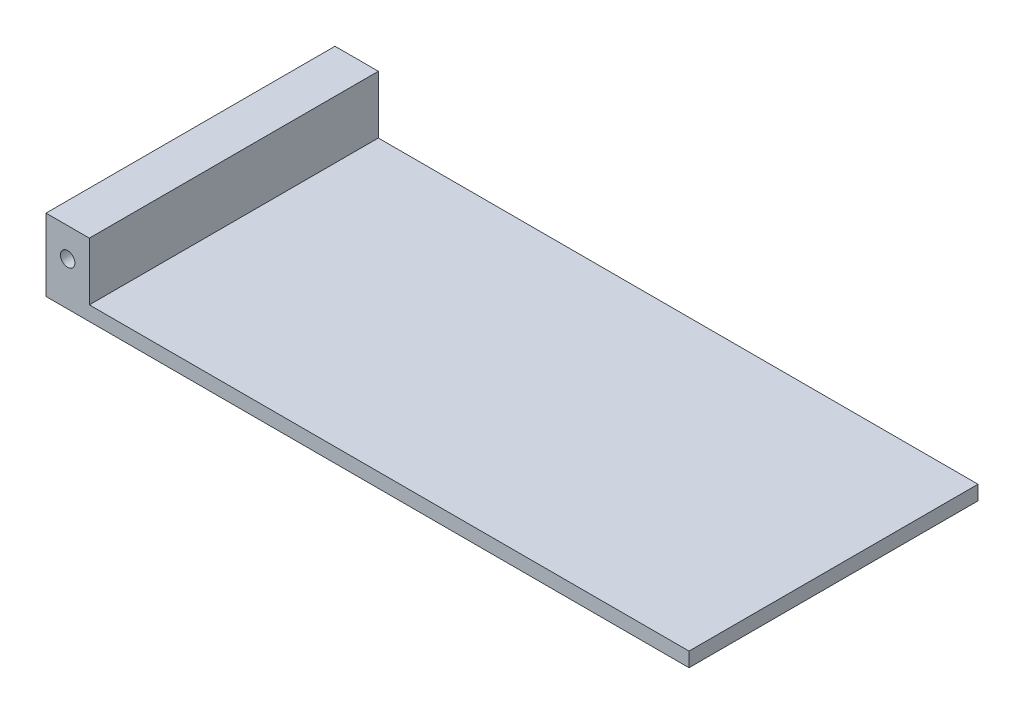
ISO-10303-21;
HEADER;
FILE_DESCRIPTION(('STEP AP214'),'2;1');
FILE_NAME('part.step','',(''),(''),'','','');
FILE_SCHEMA(('AUTOMOTIVE_DESIGN { 1 0 10303 214 1 1 1 1 }'));
ENDSEC;
DATA;
#1=APPLICATION_CONTEXT('core data for automotive mechanical design processes');
#2=APPLICATION_PROTOCOL_DEFINITION('international standard','automotive_design',2000,#1);
#3=PRODUCT_CONTEXT('',#1,'mechanical');
#4=PRODUCT('Part','Part','',(#3));
#5=PRODUCT_RELATED_PRODUCT_CATEGORY('part','',(#4));
#6=PRODUCT_DEFINITION_FORMATION('','',#4);
#7=PRODUCT_DEFINITION_CONTEXT('part definition',#1,'design');
#8=PRODUCT_DEFINITION('design','',#6,#7);
#9=PRODUCT_DEFINITION_SHAPE('','',#8);
#10=(LENGTH_UNIT() NAMED_UNIT(*) SI_UNIT(.MILLI.,.METRE.));
#11=(NAMED_UNIT(*) PLANE_ANGLE_UNIT() SI_UNIT($,.RADIAN.));
#12=(NAMED_UNIT(*) SI_UNIT($,.STERADIAN.) SOLID_ANGLE_UNIT());
#13=UNCERTAINTY_MEASURE_WITH_UNIT(LENGTH_MEASURE(1.E-05),#10,'distance_accuracy_value','');
#14=(GEOMETRIC_REPRESENTATION_CONTEXT(3) GLOBAL_UNCERTAINTY_ASSIGNED_CONTEXT((#13)) GLOBAL_UNIT_ASSIGNED_CONTEXT((#10,
#11,#12)) REPRESENTATION_CONTEXT('',''));
#15=CARTESIAN_POINT('',(0.,0.,0.));
#16=DIRECTION('',(0.,0.,1.));
#17=DIRECTION('',(1.,0.,0.));
#18=AXIS2_PLACEMENT_3D('',#15,#16,#17);
#19=CARTESIAN_POINT('',(0.,12.7,254.));
#20=DIRECTION('',(0.,-1.,0.));
#21=DIRECTION('',(0.,0.,-1.));
#22=AXIS2_PLACEMENT_3D('',#19,#20,#21);
#23=PLANE('',#22);
#24=DIRECTION('',(0.,0.,-1.));
#25=VECTOR('',#24,1.);
#26=CARTESIAN_POINT('',(38.1,12.7,254.));
#27=LINE('',#26,#25);
#28=CARTESIAN_POINT('',(38.1,12.7,254.));
#29=VERTEX_POINT('',#28);
#30=CARTESIAN_POINT('',(38.1,12.7,0.));
#31=VERTEX_POINT('',#30);
#32=EDGE_CURVE('E53',#29,#31,#27,.T.);
#33=ORIENTED_EDGE('',*,*,#32,.F.);
#34=DIRECTION('',(-1.,0.,0.));
#35=VECTOR('',#34,1.);
#36=CARTESIAN_POINT('',(0.,12.7,254.));
#37=LINE('',#36,#35);
#38=CARTESIAN_POINT('',(565.15,12.7,254.));
#39=VERTEX_POINT('',#38);
#40=EDGE_CURVE('E133',#39,#29,#37,.T.);
#41=ORIENTED_EDGE('',*,*,#40,.F.);
#42=DIRECTION('',(0.,0.,-1.));
#43=VECTOR('',#42,1.);
#44=CARTESIAN_POINT('',(565.15,12.7,254.));
#45=LINE('',#44,#43);
#46=CARTESIAN_POINT('',(565.15,12.7,0.));
#47=VERTEX_POINT('',#46);
#48=EDGE_CURVE('E152',#39,#47,#45,.T.);
#49=ORIENTED_EDGE('',*,*,#48,.T.);
#50=DIRECTION('',(-1.,0.,0.));
#51=VECTOR('',#50,1.);
#52=CARTESIAN_POINT('',(0.,12.7,0.));
#53=LINE('',#52,#51);
#54=EDGE_CURVE('E106',#47,#31,#53,.T.);
#55=ORIENTED_EDGE('',*,*,#54,.T.);
#56=EDGE_LOOP('',(#33,#41,#49,#55));
#57=FACE_BOUND('',#56,.T.);
#58=ADVANCED_FACE('F36',(#57),#23,.F.);
#59=CARTESIAN_POINT('',(0.,0.,254.));
#60=DIRECTION('',(1.,0.,0.));
#61=DIRECTION('',(0.,0.,-1.));
#62=AXIS2_PLACEMENT_3D('',#59,#60,#61);
#63=PLANE('',#62);
#64=DIRECTION('',(0.,-1.,0.));
#65=VECTOR('',#64,1.);
#66=CARTESIAN_POINT('',(0.,0.,0.));
#67=LINE('',#66,#65);
#68=CARTESIAN_POINT('',(0.,63.5,0.));
#69=VERTEX_POINT('',#68);
#70=CARTESIAN_POINT('',(0.,0.,0.));
#71=VERTEX_POINT('',#70);
#72=EDGE_CURVE('E140',#69,#71,#67,.T.);
#73=ORIENTED_EDGE('',*,*,#72,.T.);
#74=DIRECTION('',(0.,0.,-1.));
#75=VECTOR('',#74,1.);
#76=CARTESIAN_POINT('',(0.,0.,254.));
#77=LINE('',#76,#75);
#78=CARTESIAN_POINT('',(0.,0.,254.));
#79=VERTEX_POINT('',#78);
#80=EDGE_CURVE('E11',#79,#71,#77,.T.);
#81=ORIENTED_EDGE('',*,*,#80,.F.);
#82=DIRECTION('',(0.,-1.,0.));
#83=VECTOR('',#82,1.);
#84=CARTESIAN_POINT('',(0.,0.,254.));
#85=LINE('',#84,#83);
#86=CARTESIAN_POINT('',(0.,63.5,254.));
#87=VERTEX_POINT('',#86);
#88=EDGE_CURVE('E101',#87,#79,#85,.T.);
#89=ORIENTED_EDGE('',*,*,#88,.F.);
#90=DIRECTION('',(0.,0.,1.));
#91=VECTOR('',#90,1.);
#92=CARTESIAN_POINT('',(0.,63.5,254.));
#93=LINE('',#92,#91);
#94=EDGE_CURVE('E105',#69,#87,#93,.T.);
#95=ORIENTED_EDGE('',*,*,#94,.F.);
#96=EDGE_LOOP('',(#73,#81,#89,#95));
#97=FACE_BOUND('',#96,.T.);
#98=ADVANCED_FACE('F38',(#97),#63,.F.);
#99=CARTESIAN_POINT('',(0.,0.,254.));
#100=DIRECTION('',(0.,1.,0.));
#101=DIRECTION('',(0.,0.,1.));
#102=AXIS2_PLACEMENT_3D('',#99,#100,#101);
#103=PLANE('',#102);
#104=DIRECTION('',(1.,0.,0.));
#105=VECTOR('',#104,1.);
#106=CARTESIAN_POINT('',(0.,0.,0.));
#107=LINE('',#106,#105);
#108=CARTESIAN_POINT('',(565.15,0.,0.));
#109=VERTEX_POINT('',#108);
#110=EDGE_CURVE('E143',#71,#109,#107,.T.);
#111=ORIENTED_EDGE('',*,*,#110,.T.);
#112=DIRECTION('',(0.,0.,-1.));
#113=VECTOR('',#112,1.);
#114=CARTESIAN_POINT('',(565.15,0.,254.));
#115=LINE('',#114,#113);
#116=CARTESIAN_POINT('',(565.15,0.,254.));
#117=VERTEX_POINT('',#116);
#118=EDGE_CURVE('E45',#117,#109,#115,.T.);
#119=ORIENTED_EDGE('',*,*,#118,.F.);
#120=DIRECTION('',(1.,0.,0.));
#121=VECTOR('',#120,1.);
#122=CARTESIAN_POINT('',(0.,0.,254.));
#123=LINE('',#122,#121);
#124=EDGE_CURVE('E83',#79,#117,#123,.T.);
#125=ORIENTED_EDGE('',*,*,#124,.F.);
#126=ORIENTED_EDGE('',*,*,#80,.T.);
#127=EDGE_LOOP('',(#111,#119,#125,#126));
#128=FACE_BOUND('',#127,.T.);
#129=ADVANCED_FACE('F155',(#128),#103,.F.);
#130=CARTESIAN_POINT('',(565.15,0.,254.));
#131=DIRECTION('',(-1.,0.,0.));
#132=DIRECTION('',(0.,0.,1.));
#133=AXIS2_PLACEMENT_3D('',#130,#131,#132);
#134=PLANE('',#133);
#135=DIRECTION('',(0.,1.,0.));
#136=VECTOR('',#135,1.);
#137=CARTESIAN_POINT('',(565.15,0.,0.));
#138=LINE('',#137,#136);
#139=EDGE_CURVE('E78',#109,#47,#138,.T.);
#140=ORIENTED_EDGE('',*,*,#139,.T.);
#141=ORIENTED_EDGE('',*,*,#48,.F.);
#142=DIRECTION('',(0.,1.,0.));
#143=VECTOR('',#142,1.);
#144=CARTESIAN_POINT('',(565.15,0.,254.));
#145=LINE('',#144,#143);
#146=EDGE_CURVE('E61',#117,#39,#145,.T.);
#147=ORIENTED_EDGE('',*,*,#146,.F.);
#148=ORIENTED_EDGE('',*,*,#118,.T.);
#149=EDGE_LOOP('',(#140,#141,#147,#148));
#150=FACE_BOUND('',#149,.T.);
#151=ADVANCED_FACE('F156',(#150),#134,.F.);
#152=CARTESIAN_POINT('',(0.,12.7,254.));
#153=DIRECTION('',(0.,0.,-1.));
#154=DIRECTION('',(-1.,0.,0.));
#155=AXIS2_PLACEMENT_3D('',#152,#153,#154);
#156=PLANE('',#155);
#157=CARTESIAN_POINT('',(19.05,38.1,254.));
#158=DIRECTION('',(0.,0.,1.));
#159=DIRECTION('',(1.,0.,0.));
#160=AXIS2_PLACEMENT_3D('',#157,#158,#159);
#161=CIRCLE('',#160,6.35);
#162=CARTESIAN_POINT('',(25.4,38.1,254.));
#163=VERTEX_POINT('',#162);
#164=EDGE_CURVE('E124',#163,#163,#161,.T.);
#165=ORIENTED_EDGE('',*,*,#164,.F.);
#166=EDGE_LOOP('',(#165));
#167=FACE_BOUND('',#166,.T.);
#168=ORIENTED_EDGE('',*,*,#88,.T.);
#169=ORIENTED_EDGE('',*,*,#124,.T.);
#170=ORIENTED_EDGE('',*,*,#146,.T.);
#171=ORIENTED_EDGE('',*,*,#40,.T.);
#172=DIRECTION('',(0.,-1.,0.));
#173=VECTOR('',#172,1.);
#174=CARTESIAN_POINT('',(38.1,63.5,254.));
#175=LINE('',#174,#173);
#176=CARTESIAN_POINT('',(38.1,63.5,254.));
#177=VERTEX_POINT('',#176);
#178=EDGE_CURVE('E112',#177,#29,#175,.T.);
#179=ORIENTED_EDGE('',*,*,#178,.F.);
#180=DIRECTION('',(1.,0.,0.));
#181=VECTOR('',#180,1.);
#182=CARTESIAN_POINT('',(0.,63.5,254.));
#183=LINE('',#182,#181);
#184=EDGE_CURVE('E109',#87,#177,#183,.T.);
#185=ORIENTED_EDGE('',*,*,#184,.F.);
#186=EDGE_LOOP('',(#168,#169,#170,#171,#179,#185));
#187=FACE_BOUND('',#186,.T.);
#188=ADVANCED_FACE('F110',(#167,#187),#156,.F.);
#189=CARTESIAN_POINT('',(0.,12.7,0.));
#190=DIRECTION('',(0.,0.,-1.));
#191=DIRECTION('',(-1.,0.,0.));
#192=AXIS2_PLACEMENT_3D('',#189,#190,#191);
#193=PLANE('',#192);
#194=CARTESIAN_POINT('',(19.05,38.1,0.));
#195=DIRECTION('',(0.,0.,-1.));
#196=DIRECTION('',(-1.,0.,0.));
#197=AXIS2_PLACEMENT_3D('',#194,#195,#196);
#198=CIRCLE('',#197,6.35);
#199=CARTESIAN_POINT('',(12.7,38.1,0.));
#200=VERTEX_POINT('',#199);
#201=EDGE_CURVE('E40',#200,#200,#198,.T.);
#202=ORIENTED_EDGE('',*,*,#201,.F.);
#203=EDGE_LOOP('',(#202));
#204=FACE_BOUND('',#203,.T.);
#205=ORIENTED_EDGE('',*,*,#72,.F.);
#206=DIRECTION('',(-1.,0.,0.));
#207=VECTOR('',#206,1.);
#208=CARTESIAN_POINT('',(0.,63.5,0.));
#209=LINE('',#208,#207);
#210=CARTESIAN_POINT('',(38.1,63.5,0.));
#211=VERTEX_POINT('',#210);
#212=EDGE_CURVE('E120',#211,#69,#209,.T.);
#213=ORIENTED_EDGE('',*,*,#212,.F.);
#214=DIRECTION('',(0.,-1.,0.));
#215=VECTOR('',#214,1.);
#216=CARTESIAN_POINT('',(38.1,63.5,0.));
#217=LINE('',#216,#215);
#218=EDGE_CURVE('E128',#211,#31,#217,.T.);
#219=ORIENTED_EDGE('',*,*,#218,.T.);
#220=ORIENTED_EDGE('',*,*,#54,.F.);
#221=ORIENTED_EDGE('',*,*,#139,.F.);
#222=ORIENTED_EDGE('',*,*,#110,.F.);
#223=EDGE_LOOP('',(#205,#213,#219,#220,#221,#222));
#224=FACE_BOUND('',#223,.T.);
#225=ADVANCED_FACE('F164',(#204,#224),#193,.T.);
#226=CARTESIAN_POINT('',(38.1,63.5,254.));
#227=DIRECTION('',(-1.,0.,0.));
#228=DIRECTION('',(0.,0.,1.));
#229=AXIS2_PLACEMENT_3D('',#226,#227,#228);
#230=PLANE('',#229);
#231=ORIENTED_EDGE('',*,*,#32,.T.);
#232=ORIENTED_EDGE('',*,*,#218,.F.);
#233=DIRECTION('',(0.,0.,-1.));
#234=VECTOR('',#233,1.);
#235=CARTESIAN_POINT('',(38.1,63.5,254.));
#236=LINE('',#235,#234);
#237=EDGE_CURVE('E115',#177,#211,#236,.T.);
#238=ORIENTED_EDGE('',*,*,#237,.F.);
#239=ORIENTED_EDGE('',*,*,#178,.T.);
#240=EDGE_LOOP('',(#231,#232,#238,#239));
#241=FACE_BOUND('',#240,.T.);
#242=ADVANCED_FACE('F189',(#241),#230,.F.);
#243=CARTESIAN_POINT('',(0.,63.5,0.));
#244=DIRECTION('',(0.,-1.,0.));
#245=DIRECTION('',(0.,0.,-1.));
#246=AXIS2_PLACEMENT_3D('',#243,#244,#245);
#247=PLANE('',#246);
#248=ORIENTED_EDGE('',*,*,#94,.T.);
#249=ORIENTED_EDGE('',*,*,#184,.T.);
#250=ORIENTED_EDGE('',*,*,#237,.T.);
#251=ORIENTED_EDGE('',*,*,#212,.T.);
#252=EDGE_LOOP('',(#248,#249,#250,#251));
#253=FACE_BOUND('',#252,.T.);
#254=ADVANCED_FACE('F118',(#253),#247,.F.);
#255=CARTESIAN_POINT('',(19.05,38.1,-4.99999999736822E-05));
#256=DIRECTION('',(0.,0.,1.));
#257=DIRECTION('',(1.,0.,0.));
#258=AXIS2_PLACEMENT_3D('',#255,#256,#257);
#259=CYLINDRICAL_SURFACE('',#258,6.35);
#260=ORIENTED_EDGE('',*,*,#201,.T.);
#261=EDGE_LOOP('',(#260));
#262=FACE_BOUND('',#261,.T.);
#263=ORIENTED_EDGE('',*,*,#164,.T.);
#264=EDGE_LOOP('',(#263));
#265=FACE_BOUND('',#264,.T.);
#266=ADVANCED_FACE('F202',(#262,#265),#259,.F.);
#267=CLOSED_SHELL('',(#58,#98,#129,#151,#188,#225,#242,#254,#266));
#268=MANIFOLD_SOLID_BREP('B2',#267);
#269=ADVANCED_BREP_SHAPE_REPRESENTATION('',(#18,#268),#14);
#270=SHAPE_DEFINITION_REPRESENTATION(#9,#269);
ENDSEC;
END-ISO-10303-21;
